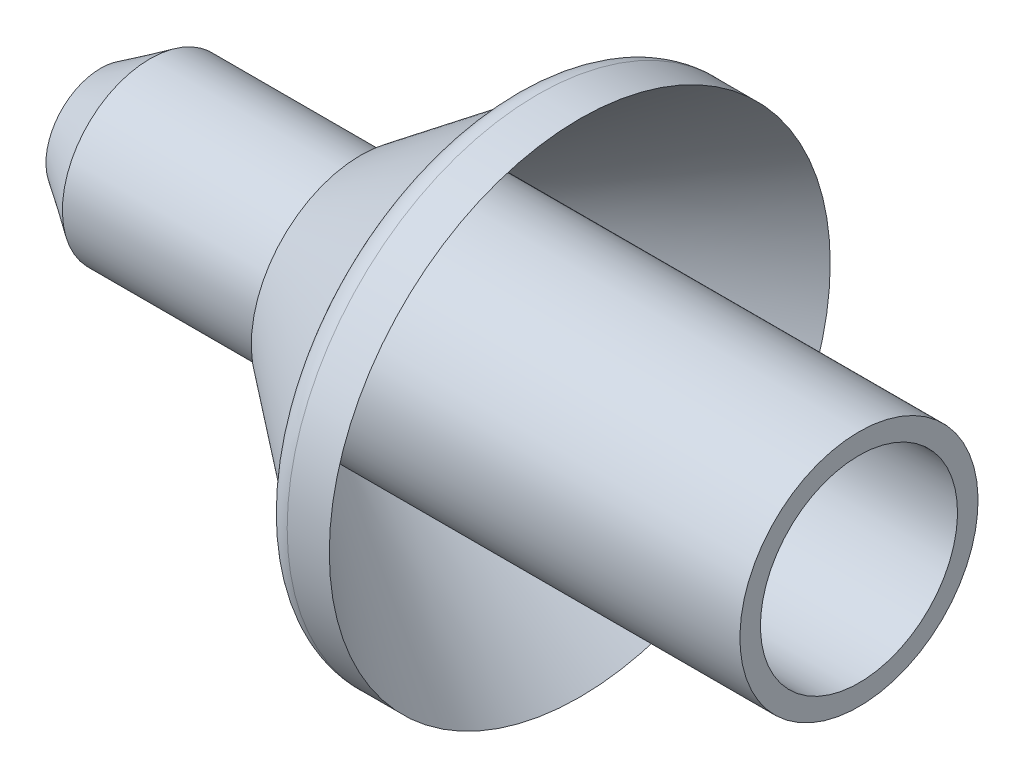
from build123d import *


with BuildPart() as part:
    # Esquisse1 → R_volution1 (revolve)
    with BuildSketch(Plane.XY):
        with BuildLine():
            Line((0, 0), (0, 2))
            Line((0, 2), (1.8, 3.2))
            Line((1.8, 3.2), (9.5, 3.2))
            Line((9.5, 3.2), (9.5, 4))
            Line((9.5, 4), (15, 8.188760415))
            ThreePointArc((15, 8.188760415), (15.281385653, 8.868444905), (15.96099997, 9.15))
            Line((15.96099997, 9.15), (17.5, 9.15))
            Line((17.5, 9.15), (11.197419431, 4.35))
            Line((11.197419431, 4.35), (27.7, 4.35))
            Line((27.7, 4.35), (27.7, 3.6))
            Line((27.7, 3.6), (11.4, 3.6))
            Line((11.4, 3.6), (11.4, 2.45))
            Line((11.4, 2.45), (2.25, 2.45))
            ThreePointArc((2.25, 2.45), (1.189339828, 2.010660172), (0.75, 0.95))
            Line((0.75, 0.95), (0.75, 0))
            Line((0.75, 0), (0, 0))
        make_face()
    revolve(axis=Axis((0.75, 0, 0), (-1, 0, 0)))


solid = part.part
